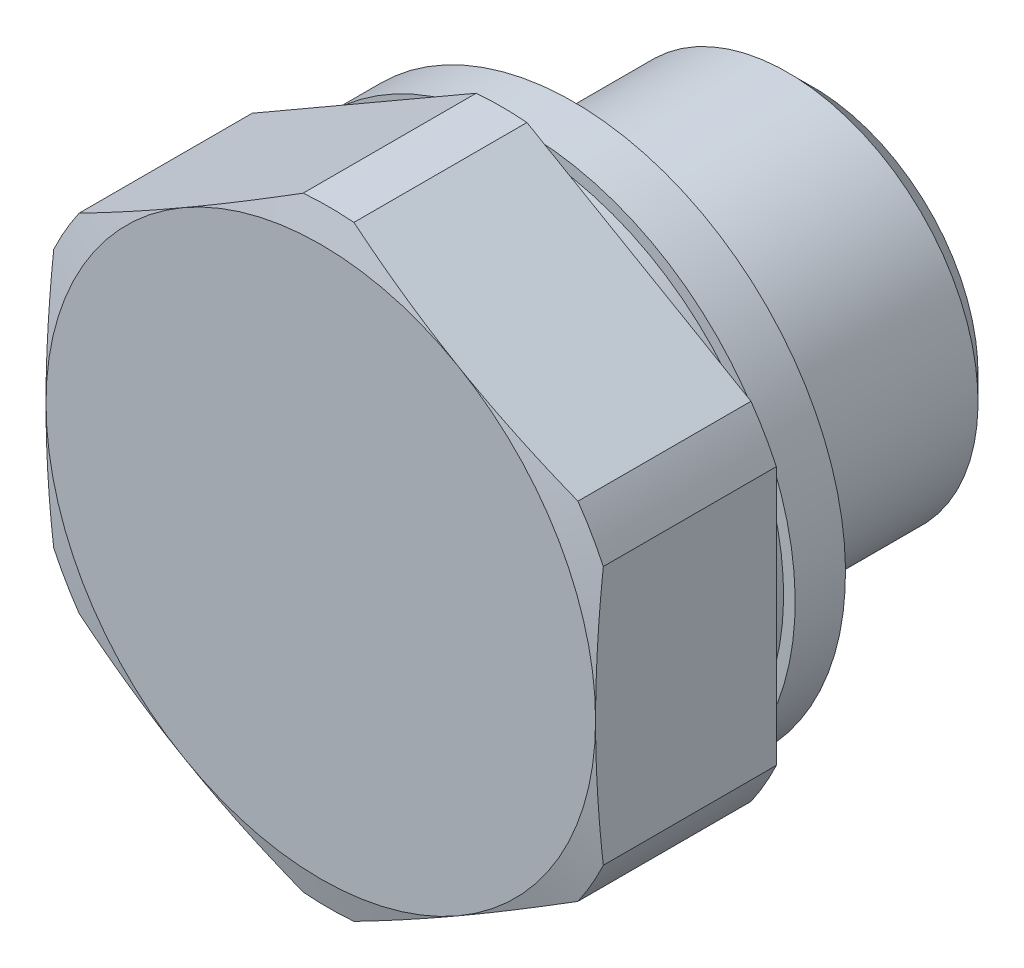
ISO-10303-21;
HEADER;
FILE_DESCRIPTION(('STEP AP214'),'2;1');
FILE_NAME('part.step','',(''),(''),'','','');
FILE_SCHEMA(('AUTOMOTIVE_DESIGN { 1 0 10303 214 1 1 1 1 }'));
ENDSEC;
DATA;
#1=APPLICATION_CONTEXT('core data for automotive mechanical design processes');
#2=APPLICATION_PROTOCOL_DEFINITION('international standard','automotive_design',2000,#1);
#3=PRODUCT_CONTEXT('',#1,'mechanical');
#4=PRODUCT('Part','Part','',(#3));
#5=PRODUCT_RELATED_PRODUCT_CATEGORY('part','',(#4));
#6=PRODUCT_DEFINITION_FORMATION('','',#4);
#7=PRODUCT_DEFINITION_CONTEXT('part definition',#1,'design');
#8=PRODUCT_DEFINITION('design','',#6,#7);
#9=PRODUCT_DEFINITION_SHAPE('','',#8);
#10=(LENGTH_UNIT() NAMED_UNIT(*) SI_UNIT(.MILLI.,.METRE.));
#11=(NAMED_UNIT(*) PLANE_ANGLE_UNIT() SI_UNIT($,.RADIAN.));
#12=(NAMED_UNIT(*) SI_UNIT($,.STERADIAN.) SOLID_ANGLE_UNIT());
#13=UNCERTAINTY_MEASURE_WITH_UNIT(LENGTH_MEASURE(1.E-05),#10,'distance_accuracy_value','');
#14=(GEOMETRIC_REPRESENTATION_CONTEXT(3) GLOBAL_UNCERTAINTY_ASSIGNED_CONTEXT((#13)) GLOBAL_UNIT_ASSIGNED_CONTEXT((#10,
#11,#12)) REPRESENTATION_CONTEXT('',''));
#15=CARTESIAN_POINT('',(0.,0.,0.));
#16=DIRECTION('',(0.,0.,1.));
#17=DIRECTION('',(1.,0.,0.));
#18=AXIS2_PLACEMENT_3D('',#15,#16,#17);
#19=CARTESIAN_POINT('',(0.,0.,-6.2999999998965));
#20=DIRECTION('',(0.,0.,-1.));
#21=DIRECTION('',(0.,1.,0.));
#22=AXIS2_PLACEMENT_3D('',#19,#20,#21);
#23=CONICAL_SURFACE('',#22,2.49999999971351,1.02974425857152);
#24=CARTESIAN_POINT('',(0.,-1.70530256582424E-10,-4.79784845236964));
#25=VERTEX_POINT('',#24);
#26=VERTEX_LOOP('',#25);
#27=FACE_BOUND('',#26,.T.);
#28=CARTESIAN_POINT('',(0.,0.,-6.3));
#29=DIRECTION('',(0.,0.,1.));
#30=DIRECTION('',(0.,-1.,0.));
#31=AXIS2_PLACEMENT_3D('',#28,#29,#30);
#32=CIRCLE('',#31,2.5);
#33=CARTESIAN_POINT('',(0.,-2.5,-6.3));
#34=VERTEX_POINT('',#33);
#35=EDGE_CURVE('E184',#34,#34,#32,.F.);
#36=ORIENTED_EDGE('',*,*,#35,.T.);
#37=EDGE_LOOP('',(#36));
#38=FACE_BOUND('',#37,.T.);
#39=ADVANCED_FACE('F14',(#27,#38),#23,.F.);
#40=CARTESIAN_POINT('',(0.,0.,-10.));
#41=DIRECTION('',(0.,0.,1.));
#42=DIRECTION('',(0.,-1.,0.));
#43=AXIS2_PLACEMENT_3D('',#40,#41,#42);
#44=CYLINDRICAL_SURFACE('',#43,2.5);
#45=CARTESIAN_POINT('',(0.,0.,-10.));
#46=DIRECTION('',(0.,0.,1.));
#47=DIRECTION('',(0.,-1.,0.));
#48=AXIS2_PLACEMENT_3D('',#45,#46,#47);
#49=CIRCLE('',#48,2.5);
#50=CARTESIAN_POINT('',(0.,-2.5,-10.));
#51=VERTEX_POINT('',#50);
#52=EDGE_CURVE('E17',#51,#51,#49,.F.);
#53=ORIENTED_EDGE('',*,*,#52,.T.);
#54=EDGE_LOOP('',(#53));
#55=FACE_BOUND('',#54,.T.);
#56=ORIENTED_EDGE('',*,*,#35,.F.);
#57=EDGE_LOOP('',(#56));
#58=FACE_BOUND('',#57,.T.);
#59=ADVANCED_FACE('F286',(#55,#58),#44,.F.);
#60=CARTESIAN_POINT('',(5.7225,0.,-10.));
#61=DIRECTION('',(0.,0.,1.));
#62=DIRECTION('',(0.,-1.,0.));
#63=AXIS2_PLACEMENT_3D('',#60,#61,#62);
#64=PLANE('',#63);
#65=CARTESIAN_POINT('',(0.,0.,-10.0000000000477));
#66=DIRECTION('',(0.,0.,1.));
#67=DIRECTION('',(0.,-1.,0.));
#68=AXIS2_PLACEMENT_3D('',#65,#66,#67);
#69=CIRCLE('',#68,5.72249999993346);
#70=CARTESIAN_POINT('',(0.,-5.72249999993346,-10.0000000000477));
#71=VERTEX_POINT('',#70);
#72=EDGE_CURVE('E181',#71,#71,#69,.T.);
#73=ORIENTED_EDGE('',*,*,#72,.F.);
#74=EDGE_LOOP('',(#73));
#75=FACE_BOUND('',#74,.T.);
#76=ORIENTED_EDGE('',*,*,#52,.F.);
#77=EDGE_LOOP('',(#76));
#78=FACE_BOUND('',#77,.T.);
#79=ADVANCED_FACE('F289',(#75,#78),#64,.F.);
#80=CARTESIAN_POINT('',(0.,0.,-9.14400000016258));
#81=DIRECTION('',(0.,0.,1.));
#82=DIRECTION('',(0.,-1.,0.));
#83=AXIS2_PLACEMENT_3D('',#80,#81,#82);
#84=CONICAL_SURFACE('',#83,6.57849999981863,0.785398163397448);
#85=CARTESIAN_POINT('',(0.,0.,-9.144));
#86=DIRECTION('',(0.,0.,1.));
#87=DIRECTION('',(0.,-1.,0.));
#88=AXIS2_PLACEMENT_3D('',#85,#86,#87);
#89=CIRCLE('',#88,6.5785);
#90=CARTESIAN_POINT('',(0.,-6.5785,-9.144));
#91=VERTEX_POINT('',#90);
#92=EDGE_CURVE('E176',#91,#91,#89,.T.);
#93=ORIENTED_EDGE('',*,*,#92,.F.);
#94=EDGE_LOOP('',(#93));
#95=FACE_BOUND('',#94,.T.);
#96=ORIENTED_EDGE('',*,*,#72,.T.);
#97=EDGE_LOOP('',(#96));
#98=FACE_BOUND('',#97,.T.);
#99=ADVANCED_FACE('F291',(#95,#98),#84,.T.);
#100=CARTESIAN_POINT('',(0.,0.,-10.));
#101=DIRECTION('',(0.,0.,1.));
#102=DIRECTION('',(0.,-1.,0.));
#103=AXIS2_PLACEMENT_3D('',#100,#101,#102);
#104=CYLINDRICAL_SURFACE('',#103,6.5785);
#105=CARTESIAN_POINT('',(0.,0.,-2.99421183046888));
#106=DIRECTION('',(0.,0.,-1.));
#107=DIRECTION('',(0.,1.,0.));
#108=AXIS2_PLACEMENT_3D('',#105,#106,#107);
#109=CIRCLE('',#108,6.57850000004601);
#110=CARTESIAN_POINT('',(0.,6.57850000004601,-2.99421183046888));
#111=VERTEX_POINT('',#110);
#112=EDGE_CURVE('E172',#111,#111,#109,.F.);
#113=ORIENTED_EDGE('',*,*,#112,.F.);
#114=EDGE_LOOP('',(#113));
#115=FACE_BOUND('',#114,.T.);
#116=ORIENTED_EDGE('',*,*,#92,.T.);
#117=EDGE_LOOP('',(#116));
#118=FACE_BOUND('',#117,.T.);
#119=ADVANCED_FACE('F299',(#115,#118),#104,.T.);
#120=CARTESIAN_POINT('',(0.,0.,-2.99421183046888));
#121=DIRECTION('',(0.,0.,-1.));
#122=DIRECTION('',(0.,1.,0.));
#123=AXIS2_PLACEMENT_3D('',#120,#121,#122);
#124=CONICAL_SURFACE('',#123,6.57850000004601,1.04719755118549);
#125=CARTESIAN_POINT('',(0.,0.,-2.49999999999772));
#126=DIRECTION('',(0.,0.,-1.));
#127=DIRECTION('',(0.,1.,0.));
#128=AXIS2_PLACEMENT_3D('',#125,#126,#127);
#129=CIRCLE('',#128,5.72249999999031);
#130=CARTESIAN_POINT('',(0.,5.72249999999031,-2.49999999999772));
#131=VERTEX_POINT('',#130);
#132=EDGE_CURVE('E175',#131,#131,#129,.T.);
#133=ORIENTED_EDGE('',*,*,#132,.T.);
#134=EDGE_LOOP('',(#133));
#135=FACE_BOUND('',#134,.T.);
#136=ORIENTED_EDGE('',*,*,#112,.T.);
#137=EDGE_LOOP('',(#136));
#138=FACE_BOUND('',#137,.T.);
#139=ADVANCED_FACE('F486',(#135,#138),#124,.T.);
#140=CARTESIAN_POINT('',(5.15,0.,-2.5));
#141=DIRECTION('',(0.,0.,-1.));
#142=DIRECTION('',(0.,1.,0.));
#143=AXIS2_PLACEMENT_3D('',#140,#141,#142);
#144=PLANE('',#143);
#145=CARTESIAN_POINT('',(0.,0.,-2.49999999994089));
#146=DIRECTION('',(0.,0.,1.));
#147=DIRECTION('',(0.,-1.,0.));
#148=AXIS2_PLACEMENT_3D('',#145,#146,#147);
#149=CIRCLE('',#148,5.15000000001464);
#150=CARTESIAN_POINT('',(0.,-5.15000000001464,-2.49999999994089));
#151=VERTEX_POINT('',#150);
#152=EDGE_CURVE('E276',#151,#151,#149,.T.);
#153=ORIENTED_EDGE('',*,*,#152,.F.);
#154=EDGE_LOOP('',(#153));
#155=FACE_BOUND('',#154,.T.);
#156=ORIENTED_EDGE('',*,*,#132,.F.);
#157=EDGE_LOOP('',(#156));
#158=FACE_BOUND('',#157,.T.);
#159=ADVANCED_FACE('F482',(#155,#158),#144,.F.);
#160=CARTESIAN_POINT('',(0.,0.,-1.70530256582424E-10));
#161=DIRECTION('',(0.,0.,1.));
#162=DIRECTION('',(0.,-1.,0.));
#163=AXIS2_PLACEMENT_3D('',#160,#161,#162);
#164=CONICAL_SURFACE('',#163,5.99999999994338,0.327738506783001);
#165=CARTESIAN_POINT('',(0.,0.,-5.6843418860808E-11));
#166=DIRECTION('',(0.,0.,1.));
#167=DIRECTION('',(0.,-1.,0.));
#168=AXIS2_PLACEMENT_3D('',#165,#166,#167);
#169=CIRCLE('',#168,5.99999999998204);
#170=CARTESIAN_POINT('',(0.,-5.99999999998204,-5.6843418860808E-11));
#171=VERTEX_POINT('',#170);
#172=EDGE_CURVE('E273',#171,#171,#169,.F.);
#173=ORIENTED_EDGE('',*,*,#172,.T.);
#174=EDGE_LOOP('',(#173));
#175=FACE_BOUND('',#174,.T.);
#176=ORIENTED_EDGE('',*,*,#152,.T.);
#177=EDGE_LOOP('',(#176));
#178=FACE_BOUND('',#177,.T.);
#179=ADVANCED_FACE('F478',(#175,#178),#164,.T.);
#180=CARTESIAN_POINT('',(9.,0.,0.));
#181=DIRECTION('',(0.,0.,1.));
#182=DIRECTION('',(0.,-1.,0.));
#183=AXIS2_PLACEMENT_3D('',#180,#181,#182);
#184=PLANE('',#183);
#185=CARTESIAN_POINT('',(0.,0.,0.));
#186=DIRECTION('',(0.,0.,1.));
#187=DIRECTION('',(0.,-1.,0.));
#188=AXIS2_PLACEMENT_3D('',#185,#186,#187);
#189=CIRCLE('',#188,6.5785);
#190=CARTESIAN_POINT('',(0.,-6.5785,0.));
#191=VERTEX_POINT('',#190);
#192=EDGE_CURVE('E270',#191,#191,#189,.F.);
#193=ORIENTED_EDGE('',*,*,#192,.T.);
#194=EDGE_LOOP('',(#193));
#195=FACE_BOUND('',#194,.T.);
#196=ORIENTED_EDGE('',*,*,#172,.F.);
#197=EDGE_LOOP('',(#196));
#198=FACE_BOUND('',#197,.T.);
#199=ADVANCED_FACE('F474',(#195,#198),#184,.F.);
#200=CARTESIAN_POINT('',(0.,0.,-1.74));
#201=DIRECTION('',(0.,0.,1.));
#202=DIRECTION('',(0.,-1.,0.));
#203=AXIS2_PLACEMENT_3D('',#200,#201,#202);
#204=CYLINDRICAL_SURFACE('',#203,6.5785);
#205=ORIENTED_EDGE('',*,*,#192,.F.);
#206=EDGE_LOOP('',(#205));
#207=FACE_BOUND('',#206,.T.);
#208=CARTESIAN_POINT('',(0.,0.,-1.74));
#209=DIRECTION('',(0.,0.,1.));
#210=DIRECTION('',(0.,-1.,0.));
#211=AXIS2_PLACEMENT_3D('',#208,#209,#210);
#212=CIRCLE('',#211,6.5785);
#213=CARTESIAN_POINT('',(0.,-6.5785,-1.74));
#214=VERTEX_POINT('',#213);
#215=EDGE_CURVE('E267',#214,#214,#212,.T.);
#216=ORIENTED_EDGE('',*,*,#215,.F.);
#217=EDGE_LOOP('',(#216));
#218=FACE_BOUND('',#217,.T.);
#219=ADVANCED_FACE('F470',(#207,#218),#204,.F.);
#220=CARTESIAN_POINT('',(6.5785,0.,-1.74));
#221=DIRECTION('',(0.,0.,-1.));
#222=DIRECTION('',(0.,1.,0.));
#223=AXIS2_PLACEMENT_3D('',#220,#221,#222);
#224=PLANE('',#223);
#225=ORIENTED_EDGE('',*,*,#215,.T.);
#226=EDGE_LOOP('',(#225));
#227=FACE_BOUND('',#226,.T.);
#228=CARTESIAN_POINT('',(0.,0.,-1.74));
#229=DIRECTION('',(0.,0.,1.));
#230=DIRECTION('',(0.,-1.,0.));
#231=AXIS2_PLACEMENT_3D('',#228,#229,#230);
#232=CIRCLE('',#231,9.4);
#233=CARTESIAN_POINT('',(0.,-9.4,-1.74));
#234=VERTEX_POINT('',#233);
#235=EDGE_CURVE('E264',#234,#234,#232,.T.);
#236=ORIENTED_EDGE('',*,*,#235,.F.);
#237=EDGE_LOOP('',(#236));
#238=FACE_BOUND('',#237,.T.);
#239=ADVANCED_FACE('F466',(#227,#238),#224,.T.);
#240=CARTESIAN_POINT('',(0.,0.,-1.74));
#241=DIRECTION('',(0.,0.,1.));
#242=DIRECTION('',(0.,-1.,0.));
#243=AXIS2_PLACEMENT_3D('',#240,#241,#242);
#244=CYLINDRICAL_SURFACE('',#243,9.4);
#245=ORIENTED_EDGE('',*,*,#235,.T.);
#246=EDGE_LOOP('',(#245));
#247=FACE_BOUND('',#246,.T.);
#248=CARTESIAN_POINT('',(0.,0.,0.));
#249=DIRECTION('',(0.,0.,1.));
#250=DIRECTION('',(0.,-1.,0.));
#251=AXIS2_PLACEMENT_3D('',#248,#249,#250);
#252=CIRCLE('',#251,9.4);
#253=CARTESIAN_POINT('',(0.,-9.4,0.));
#254=VERTEX_POINT('',#253);
#255=EDGE_CURVE('E261',#254,#254,#252,.T.);
#256=ORIENTED_EDGE('',*,*,#255,.F.);
#257=EDGE_LOOP('',(#256));
#258=FACE_BOUND('',#257,.T.);
#259=ADVANCED_FACE('F462',(#247,#258),#244,.T.);
#260=CARTESIAN_POINT('',(9.4,0.,0.));
#261=DIRECTION('',(0.,0.,1.));
#262=DIRECTION('',(0.,-1.,0.));
#263=AXIS2_PLACEMENT_3D('',#260,#261,#262);
#264=PLANE('',#263);
#265=ORIENTED_EDGE('',*,*,#255,.T.);
#266=EDGE_LOOP('',(#265));
#267=FACE_BOUND('',#266,.T.);
#268=CARTESIAN_POINT('',(0.,0.,0.));
#269=DIRECTION('',(0.,0.,1.));
#270=DIRECTION('',(0.,-1.,0.));
#271=AXIS2_PLACEMENT_3D('',#268,#269,#270);
#272=CIRCLE('',#271,9.);
#273=CARTESIAN_POINT('',(0.,-9.,0.));
#274=VERTEX_POINT('',#273);
#275=EDGE_CURVE('E258',#274,#274,#272,.T.);
#276=ORIENTED_EDGE('',*,*,#275,.F.);
#277=EDGE_LOOP('',(#276));
#278=FACE_BOUND('',#277,.T.);
#279=ADVANCED_FACE('F458',(#267,#278),#264,.T.);
#280=CARTESIAN_POINT('',(0.,0.,-10.));
#281=DIRECTION('',(0.,0.,1.));
#282=DIRECTION('',(0.,-1.,0.));
#283=AXIS2_PLACEMENT_3D('',#280,#281,#282);
#284=CYLINDRICAL_SURFACE('',#283,9.);
#285=CARTESIAN_POINT('',(0.,0.,0.75));
#286=DIRECTION('',(0.,0.,1.));
#287=DIRECTION('',(0.,-1.,0.));
#288=AXIS2_PLACEMENT_3D('',#285,#286,#287);
#289=CIRCLE('',#288,9.);
#290=CARTESIAN_POINT('',(0.,-9.,0.75));
#291=VERTEX_POINT('',#290);
#292=EDGE_CURVE('E141',#291,#291,#289,.F.);
#293=ORIENTED_EDGE('',*,*,#292,.T.);
#294=EDGE_LOOP('',(#293));
#295=FACE_BOUND('',#294,.T.);
#296=ORIENTED_EDGE('',*,*,#275,.T.);
#297=EDGE_LOOP('',(#296));
#298=FACE_BOUND('',#297,.T.);
#299=ADVANCED_FACE('F455',(#295,#298),#284,.T.);
#300=CARTESIAN_POINT('',(13.5,0.,0.75));
#301=DIRECTION('',(0.,0.,1.));
#302=DIRECTION('',(0.,-1.,0.));
#303=AXIS2_PLACEMENT_3D('',#300,#301,#302);
#304=PLANE('',#303);
#305=DIRECTION('',(0.866025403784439,0.5,0.));
#306=VECTOR('',#305,1.);
#307=CARTESIAN_POINT('',(0.,-10.9696551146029,0.75));
#308=LINE('',#307,#306);
#309=CARTESIAN_POINT('',(0.877016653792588,-10.463309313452,0.75));
#310=VERTEX_POINT('',#309);
#311=CARTESIAN_POINT('',(8.62298334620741,-5.99117335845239,0.75));
#312=VERTEX_POINT('',#311);
#313=EDGE_CURVE('E137',#310,#312,#308,.T.);
#314=ORIENTED_EDGE('',*,*,#313,.F.);
#315=CARTESIAN_POINT('',(0.,0.,0.75));
#316=DIRECTION('',(0.,0.,-1.));
#317=DIRECTION('',(0.,1.,0.));
#318=AXIS2_PLACEMENT_3D('',#315,#316,#317);
#319=CIRCLE('',#318,10.5);
#320=CARTESIAN_POINT('',(-0.877016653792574,-10.463309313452,0.75));
#321=VERTEX_POINT('',#320);
#322=EDGE_CURVE('E133',#321,#310,#319,.F.);
#323=ORIENTED_EDGE('',*,*,#322,.F.);
#324=DIRECTION('',(0.866025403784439,-0.5,0.));
#325=VECTOR('',#324,1.);
#326=CARTESIAN_POINT('',(-9.5,-5.48482755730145,0.75));
#327=LINE('',#326,#325);
#328=CARTESIAN_POINT('',(-8.62298334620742,-5.99117335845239,0.75));
#329=VERTEX_POINT('',#328);
#330=EDGE_CURVE('E117',#329,#321,#327,.T.);
#331=ORIENTED_EDGE('',*,*,#330,.F.);
#332=CARTESIAN_POINT('',(0.,0.,0.75));
#333=DIRECTION('',(0.,0.,-1.));
#334=DIRECTION('',(0.,1.,0.));
#335=AXIS2_PLACEMENT_3D('',#332,#333,#334);
#336=CIRCLE('',#335,10.5);
#337=CARTESIAN_POINT('',(-9.5,-4.47213595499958,0.75));
#338=VERTEX_POINT('',#337);
#339=EDGE_CURVE('E129',#338,#329,#336,.F.);
#340=ORIENTED_EDGE('',*,*,#339,.F.);
#341=DIRECTION('',(0.,-1.,0.));
#342=VECTOR('',#341,1.);
#343=CARTESIAN_POINT('',(-9.5,5.48482755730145,0.75));
#344=LINE('',#343,#342);
#345=CARTESIAN_POINT('',(-9.5,4.47213595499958,0.75));
#346=VERTEX_POINT('',#345);
#347=EDGE_CURVE('E169',#346,#338,#344,.T.);
#348=ORIENTED_EDGE('',*,*,#347,.F.);
#349=CARTESIAN_POINT('',(0.,0.,0.75));
#350=DIRECTION('',(0.,0.,-1.));
#351=DIRECTION('',(0.,1.,0.));
#352=AXIS2_PLACEMENT_3D('',#349,#350,#351);
#353=CIRCLE('',#352,10.5);
#354=CARTESIAN_POINT('',(-8.62298334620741,5.99117335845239,0.75));
#355=VERTEX_POINT('',#354);
#356=EDGE_CURVE('E147',#355,#346,#353,.F.);
#357=ORIENTED_EDGE('',*,*,#356,.F.);
#358=DIRECTION('',(-0.866025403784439,-0.5,0.));
#359=VECTOR('',#358,1.);
#360=CARTESIAN_POINT('',(0.,10.9696551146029,0.75));
#361=LINE('',#360,#359);
#362=CARTESIAN_POINT('',(-0.877016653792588,10.463309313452,0.75));
#363=VERTEX_POINT('',#362);
#364=EDGE_CURVE('E165',#363,#355,#361,.T.);
#365=ORIENTED_EDGE('',*,*,#364,.F.);
#366=CARTESIAN_POINT('',(0.,0.,0.75));
#367=DIRECTION('',(0.,0.,-1.));
#368=DIRECTION('',(0.,1.,0.));
#369=AXIS2_PLACEMENT_3D('',#366,#367,#368);
#370=CIRCLE('',#369,10.5);
#371=CARTESIAN_POINT('',(0.877016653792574,10.463309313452,0.75));
#372=VERTEX_POINT('',#371);
#373=EDGE_CURVE('E168',#372,#363,#370,.F.);
#374=ORIENTED_EDGE('',*,*,#373,.F.);
#375=DIRECTION('',(-0.866025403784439,0.5,0.));
#376=VECTOR('',#375,1.);
#377=CARTESIAN_POINT('',(9.5,5.48482755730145,0.75));
#378=LINE('',#377,#376);
#379=CARTESIAN_POINT('',(8.62298334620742,5.99117335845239,0.75));
#380=VERTEX_POINT('',#379);
#381=EDGE_CURVE('E161',#380,#372,#378,.T.);
#382=ORIENTED_EDGE('',*,*,#381,.F.);
#383=CARTESIAN_POINT('',(0.,0.,0.75));
#384=DIRECTION('',(0.,0.,-1.));
#385=DIRECTION('',(0.,1.,0.));
#386=AXIS2_PLACEMENT_3D('',#383,#384,#385);
#387=CIRCLE('',#386,10.5);
#388=CARTESIAN_POINT('',(9.5,4.47213595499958,0.75));
#389=VERTEX_POINT('',#388);
#390=EDGE_CURVE('E164',#389,#380,#387,.F.);
#391=ORIENTED_EDGE('',*,*,#390,.F.);
#392=DIRECTION('',(0.,1.,0.));
#393=VECTOR('',#392,1.);
#394=CARTESIAN_POINT('',(9.5,-5.48482755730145,0.75));
#395=LINE('',#394,#393);
#396=CARTESIAN_POINT('',(9.5,-4.47213595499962,0.75));
#397=VERTEX_POINT('',#396);
#398=EDGE_CURVE('E157',#397,#389,#395,.T.);
#399=ORIENTED_EDGE('',*,*,#398,.F.);
#400=CARTESIAN_POINT('',(0.,0.,0.75));
#401=DIRECTION('',(0.,0.,-1.));
#402=DIRECTION('',(0.,1.,0.));
#403=AXIS2_PLACEMENT_3D('',#400,#401,#402);
#404=CIRCLE('',#403,10.5);
#405=EDGE_CURVE('E160',#312,#397,#404,.F.);
#406=ORIENTED_EDGE('',*,*,#405,.F.);
#407=EDGE_LOOP('',(#314,#323,#331,#340,#348,#357,#365,#374,#382,#391,#399,#406));
#408=FACE_BOUND('',#407,.T.);
#409=ORIENTED_EDGE('',*,*,#292,.F.);
#410=EDGE_LOOP('',(#409));
#411=FACE_BOUND('',#410,.T.);
#412=ADVANCED_FACE('F134',(#408,#411),#304,.F.);
#413=CARTESIAN_POINT('',(0.,0.,0.));
#414=DIRECTION('',(0.,0.,-1.));
#415=DIRECTION('',(0.,1.,0.));
#416=AXIS2_PLACEMENT_3D('',#413,#414,#415);
#417=CYLINDRICAL_SURFACE('',#416,10.5);
#418=CARTESIAN_POINT('',(0.,0.,6.73205080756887));
#419=DIRECTION('',(0.,0.,-1.));
#420=DIRECTION('',(0.,1.,0.));
#421=AXIS2_PLACEMENT_3D('',#418,#419,#420);
#422=CIRCLE('',#421,10.5);
#423=CARTESIAN_POINT('',(-0.877016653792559,-10.463309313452,6.73205080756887));
#424=VERTEX_POINT('',#423);
#425=CARTESIAN_POINT('',(0.877016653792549,-10.463309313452,6.73205080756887));
#426=VERTEX_POINT('',#425);
#427=EDGE_CURVE('E145',#424,#426,#422,.F.);
#428=ORIENTED_EDGE('',*,*,#427,.F.);
#429=DIRECTION('',(0.,0.,1.));
#430=VECTOR('',#429,1.);
#431=CARTESIAN_POINT('',(-0.877016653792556,-10.463309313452,0.));
#432=LINE('',#431,#430);
#433=EDGE_CURVE('E123',#321,#424,#432,.T.);
#434=ORIENTED_EDGE('',*,*,#433,.F.);
#435=ORIENTED_EDGE('',*,*,#322,.T.);
#436=DIRECTION('',(0.,0.,1.));
#437=VECTOR('',#436,1.);
#438=CARTESIAN_POINT('',(0.877016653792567,-10.463309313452,0.));
#439=LINE('',#438,#437);
#440=EDGE_CURVE('E153',#426,#310,#439,.F.);
#441=ORIENTED_EDGE('',*,*,#440,.F.);
#442=EDGE_LOOP('',(#428,#434,#435,#441));
#443=FACE_BOUND('',#442,.T.);
#444=ADVANCED_FACE('F144',(#443),#417,.T.);
#445=CARTESIAN_POINT('',(0.,0.,0.));
#446=DIRECTION('',(0.,0.,-1.));
#447=DIRECTION('',(0.,1.,0.));
#448=AXIS2_PLACEMENT_3D('',#445,#446,#447);
#449=CYLINDRICAL_SURFACE('',#448,10.5);
#450=CARTESIAN_POINT('',(0.,0.,6.73205080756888));
#451=DIRECTION('',(0.,0.,-1.));
#452=DIRECTION('',(0.,1.,0.));
#453=AXIS2_PLACEMENT_3D('',#450,#451,#452);
#454=CIRCLE('',#453,10.5);
#455=CARTESIAN_POINT('',(-9.5,-4.47213595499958,6.73205080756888));
#456=VERTEX_POINT('',#455);
#457=CARTESIAN_POINT('',(-8.62298334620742,-5.99117335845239,6.73205080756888));
#458=VERTEX_POINT('',#457);
#459=EDGE_CURVE('E430',#456,#458,#454,.F.);
#460=ORIENTED_EDGE('',*,*,#459,.F.);
#461=DIRECTION('',(0.,0.,1.));
#462=VECTOR('',#461,1.);
#463=CARTESIAN_POINT('',(-9.5,-4.47213595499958,0.));
#464=LINE('',#463,#462);
#465=EDGE_CURVE('E170',#338,#456,#464,.T.);
#466=ORIENTED_EDGE('',*,*,#465,.F.);
#467=ORIENTED_EDGE('',*,*,#339,.T.);
#468=DIRECTION('',(0.,0.,1.));
#469=VECTOR('',#468,1.);
#470=CARTESIAN_POINT('',(-8.62298334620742,-5.99117335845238,0.));
#471=LINE('',#470,#469);
#472=EDGE_CURVE('E126',#458,#329,#471,.F.);
#473=ORIENTED_EDGE('',*,*,#472,.F.);
#474=EDGE_LOOP('',(#460,#466,#467,#473));
#475=FACE_BOUND('',#474,.T.);
#476=ADVANCED_FACE('F433',(#475),#449,.T.);
#477=CARTESIAN_POINT('',(-9.5,-5.48482755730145,0.));
#478=DIRECTION('',(-0.5,-0.866025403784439,0.));
#479=DIRECTION('',(0.866025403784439,-0.5,0.));
#480=AXIS2_PLACEMENT_3D('',#477,#478,#479);
#481=PLANE('',#480);
#482=CARTESIAN_POINT('',(-8.62298334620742,-5.99117335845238,6.73205080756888));
#483=CARTESIAN_POINT('',(-8.30146981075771,-6.17679928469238,6.77444751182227));
#484=CARTESIAN_POINT('',(-7.9795052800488,-6.36268559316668,6.81253431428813));
#485=CARTESIAN_POINT('',(-7.33509348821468,-6.73473691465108,6.87894573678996));
#486=CARTESIAN_POINT('',(-7.01264684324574,-6.92090157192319,6.90727837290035));
#487=CARTESIAN_POINT('',(-6.3671217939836,-7.29359563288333,6.95311530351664));
#488=CARTESIAN_POINT('',(-6.04404331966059,-7.4801250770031,6.97061832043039));
#489=CARTESIAN_POINT('',(-5.55906653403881,-7.76012655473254,6.98820474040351));
#490=CARTESIAN_POINT('',(-5.39727920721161,-7.8535345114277,6.9926222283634));
#491=CARTESIAN_POINT('',(-5.07366224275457,-8.0403748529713,6.99852220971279));
#492=CARTESIAN_POINT('',(-4.91183260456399,-8.13380723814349,7.00000466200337));
#493=CARTESIAN_POINT('',(-4.75,-8.22724133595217,7.));
#494=B_SPLINE_CURVE_WITH_KNOTS('',3,(#482,#483,#484,#485,#486,#487,#488,#489,#490,#491,#492,
#493),.UNSPECIFIED.,.F.,.F.,(4,2,2,2,2,4),(0.,1.12101038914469,2.24109730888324,
3.36131634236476,3.92190059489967,4.48249269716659),.UNSPECIFIED.);
#495=CARTESIAN_POINT('',(-4.75,-8.22724133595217,7.));
#496=VERTEX_POINT('',#495);
#497=EDGE_CURVE('E384',#458,#496,#494,.T.);
#498=ORIENTED_EDGE('',*,*,#497,.F.);
#499=ORIENTED_EDGE('',*,*,#472,.T.);
#500=ORIENTED_EDGE('',*,*,#330,.T.);
#501=ORIENTED_EDGE('',*,*,#433,.T.);
#502=CARTESIAN_POINT('',(-4.75,-8.22724133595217,7.));
#503=CARTESIAN_POINT('',(-4.58816739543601,-8.32067543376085,7.00000466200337));
#504=CARTESIAN_POINT('',(-4.42633775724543,-8.41410781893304,6.99852220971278));
#505=CARTESIAN_POINT('',(-4.10272079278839,-8.60094816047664,6.99262222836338));
#506=CARTESIAN_POINT('',(-3.94093346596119,-8.6943561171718,6.9882047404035));
#507=CARTESIAN_POINT('',(-3.45595668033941,-8.97435759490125,6.97061832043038));
#508=CARTESIAN_POINT('',(-3.1328782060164,-9.16088703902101,6.95311530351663));
#509=CARTESIAN_POINT('',(-2.48735315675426,-9.53358109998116,6.90727837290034));
#510=CARTESIAN_POINT('',(-2.16490651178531,-9.71974575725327,6.87894573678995));
#511=CARTESIAN_POINT('',(-1.52049471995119,-10.0917970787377,6.81253431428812));
#512=CARTESIAN_POINT('',(-1.19853018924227,-10.277683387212,6.77444751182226));
#513=CARTESIAN_POINT('',(-0.877016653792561,-10.463309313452,6.73205080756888));
#514=B_SPLINE_CURVE_WITH_KNOTS('',3,(#502,#503,#504,#505,#506,#507,#508,#509,#510,#511,#512,
#513),.UNSPECIFIED.,.F.,.F.,(4,2,2,2,2,4),(0.,0.560592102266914,1.12117635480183,
2.24139538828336,3.36148230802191,4.48249269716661),.UNSPECIFIED.);
#515=EDGE_CURVE('E241',#496,#424,#514,.T.);
#516=ORIENTED_EDGE('',*,*,#515,.F.);
#517=EDGE_LOOP('',(#498,#499,#500,#501,#516));
#518=FACE_BOUND('',#517,.T.);
#519=ADVANCED_FACE('F120',(#518),#481,.T.);
#520=CARTESIAN_POINT('',(0.,0.,0.));
#521=DIRECTION('',(0.,0.,-1.));
#522=DIRECTION('',(0.,1.,0.));
#523=AXIS2_PLACEMENT_3D('',#520,#521,#522);
#524=CYLINDRICAL_SURFACE('',#523,10.5);
#525=CARTESIAN_POINT('',(0.,0.,6.73205080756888));
#526=DIRECTION('',(0.,0.,-1.));
#527=DIRECTION('',(0.,1.,0.));
#528=AXIS2_PLACEMENT_3D('',#525,#526,#527);
#529=CIRCLE('',#528,10.5);
#530=CARTESIAN_POINT('',(-8.62298334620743,5.99117335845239,6.73205080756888));
#531=VERTEX_POINT('',#530);
#532=CARTESIAN_POINT('',(-9.5,4.47213595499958,6.73205080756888));
#533=VERTEX_POINT('',#532);
#534=EDGE_CURVE('E339',#531,#533,#529,.F.);
#535=ORIENTED_EDGE('',*,*,#534,.F.);
#536=DIRECTION('',(0.,0.,1.));
#537=VECTOR('',#536,1.);
#538=CARTESIAN_POINT('',(-8.62298334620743,5.99117335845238,0.));
#539=LINE('',#538,#537);
#540=EDGE_CURVE('E167',#355,#531,#539,.T.);
#541=ORIENTED_EDGE('',*,*,#540,.F.);
#542=ORIENTED_EDGE('',*,*,#356,.T.);
#543=DIRECTION('',(0.,0.,1.));
#544=VECTOR('',#543,1.);
#545=CARTESIAN_POINT('',(-9.5,4.47213595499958,0.));
#546=LINE('',#545,#544);
#547=EDGE_CURVE('E253',#533,#346,#546,.F.);
#548=ORIENTED_EDGE('',*,*,#547,.F.);
#549=EDGE_LOOP('',(#535,#541,#542,#548));
#550=FACE_BOUND('',#549,.T.);
#551=ADVANCED_FACE('F375',(#550),#524,.T.);
#552=CARTESIAN_POINT('',(-9.5,5.48482755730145,0.));
#553=DIRECTION('',(-1.,0.,0.));
#554=DIRECTION('',(0.,-1.,0.));
#555=AXIS2_PLACEMENT_3D('',#552,#553,#554);
#556=PLANE('',#555);
#557=CARTESIAN_POINT('',(-9.5,4.47213595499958,6.73205080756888));
#558=CARTESIAN_POINT('',(-9.5,4.10088410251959,6.77444751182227));
#559=CARTESIAN_POINT('',(-9.5,3.72911148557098,6.81253431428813));
#560=CARTESIAN_POINT('',(-9.5,2.98500884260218,6.87894573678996));
#561=CARTESIAN_POINT('',(-9.5,2.61267952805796,6.90727837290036));
#562=CARTESIAN_POINT('',(-9.5,1.86729140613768,6.95311530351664));
#563=CARTESIAN_POINT('',(-9.5,1.49423251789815,6.97061832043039));
#564=CARTESIAN_POINT('',(-9.5,0.934229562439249,6.98820474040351));
#565=CARTESIAN_POINT('',(-9.5,0.747413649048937,6.9926222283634));
#566=CARTESIAN_POINT('',(-9.5,0.373732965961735,6.99852220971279));
#567=CARTESIAN_POINT('',(-9.5,0.186868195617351,7.00000466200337));
#568=CARTESIAN_POINT('',(-9.5,0.,7.));
#569=B_SPLINE_CURVE_WITH_KNOTS('',3,(#557,#558,#559,#560,#561,#562,#563,#564,#565,#566,#567,
#568),.UNSPECIFIED.,.F.,.F.,(4,2,2,2,2,4),(0.,1.12101038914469,2.24109730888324,
3.36131634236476,3.92190059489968,4.48249269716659),.UNSPECIFIED.);
#570=CARTESIAN_POINT('',(-9.5,0.,7.));
#571=VERTEX_POINT('',#570);
#572=EDGE_CURVE('E336',#533,#571,#569,.T.);
#573=ORIENTED_EDGE('',*,*,#572,.F.);
#574=ORIENTED_EDGE('',*,*,#547,.T.);
#575=ORIENTED_EDGE('',*,*,#347,.T.);
#576=ORIENTED_EDGE('',*,*,#465,.T.);
#577=CARTESIAN_POINT('',(-9.5,0.,7.));
#578=CARTESIAN_POINT('',(-9.5,-0.186868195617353,7.00000466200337));
#579=CARTESIAN_POINT('',(-9.5,-0.373732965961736,6.99852220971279));
#580=CARTESIAN_POINT('',(-9.5,-0.747413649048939,6.9926222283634));
#581=CARTESIAN_POINT('',(-9.5,-0.934229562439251,6.98820474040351));
#582=CARTESIAN_POINT('',(-9.5,-1.49423251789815,6.97061832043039));
#583=CARTESIAN_POINT('',(-9.5,-1.86729140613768,6.95311530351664));
#584=CARTESIAN_POINT('',(-9.5,-2.61267952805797,6.90727837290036));
#585=CARTESIAN_POINT('',(-9.5,-2.98500884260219,6.87894573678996));
#586=CARTESIAN_POINT('',(-9.5,-3.72911148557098,6.81253431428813));
#587=CARTESIAN_POINT('',(-9.5,-4.10088410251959,6.77444751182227));
#588=CARTESIAN_POINT('',(-9.5,-4.47213595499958,6.73205080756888));
#589=B_SPLINE_CURVE_WITH_KNOTS('',3,(#577,#578,#579,#580,#581,#582,#583,#584,#585,#586,#587,
#588),.UNSPECIFIED.,.F.,.F.,(4,2,2,2,2,4),(0.,0.560592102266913,1.12117635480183,
2.24139538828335,3.3614823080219,4.48249269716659),.UNSPECIFIED.);
#590=EDGE_CURVE('E378',#571,#456,#589,.T.);
#591=ORIENTED_EDGE('',*,*,#590,.F.);
#592=EDGE_LOOP('',(#573,#574,#575,#576,#591));
#593=FACE_BOUND('',#592,.T.);
#594=ADVANCED_FACE('F370',(#593),#556,.T.);
#595=CARTESIAN_POINT('',(0.,0.,0.));
#596=DIRECTION('',(0.,0.,-1.));
#597=DIRECTION('',(0.,1.,0.));
#598=AXIS2_PLACEMENT_3D('',#595,#596,#597);
#599=CYLINDRICAL_SURFACE('',#598,10.5);
#600=CARTESIAN_POINT('',(0.,0.,6.73205080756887));
#601=DIRECTION('',(0.,0.,-1.));
#602=DIRECTION('',(0.,1.,0.));
#603=AXIS2_PLACEMENT_3D('',#600,#601,#602);
#604=CIRCLE('',#603,10.5);
#605=CARTESIAN_POINT('',(0.87701665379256,10.463309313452,6.73205080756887));
#606=VERTEX_POINT('',#605);
#607=CARTESIAN_POINT('',(-0.877016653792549,10.463309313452,6.73205080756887));
#608=VERTEX_POINT('',#607);
#609=EDGE_CURVE('E325',#606,#608,#604,.F.);
#610=ORIENTED_EDGE('',*,*,#609,.F.);
#611=DIRECTION('',(0.,0.,1.));
#612=VECTOR('',#611,1.);
#613=CARTESIAN_POINT('',(0.877016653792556,10.463309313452,0.));
#614=LINE('',#613,#612);
#615=EDGE_CURVE('E163',#372,#606,#614,.T.);
#616=ORIENTED_EDGE('',*,*,#615,.F.);
#617=ORIENTED_EDGE('',*,*,#373,.T.);
#618=DIRECTION('',(0.,0.,1.));
#619=VECTOR('',#618,1.);
#620=CARTESIAN_POINT('',(-0.877016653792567,10.463309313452,0.));
#621=LINE('',#620,#619);
#622=EDGE_CURVE('E251',#608,#363,#621,.F.);
#623=ORIENTED_EDGE('',*,*,#622,.F.);
#624=EDGE_LOOP('',(#610,#616,#617,#623));
#625=FACE_BOUND('',#624,.T.);
#626=ADVANCED_FACE('F366',(#625),#599,.T.);
#627=CARTESIAN_POINT('',(0.,10.9696551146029,0.));
#628=DIRECTION('',(-0.5,0.866025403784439,0.));
#629=DIRECTION('',(-0.866025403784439,-0.5,0.));
#630=AXIS2_PLACEMENT_3D('',#627,#628,#629);
#631=PLANE('',#630);
#632=CARTESIAN_POINT('',(-0.87701665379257,10.463309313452,6.73205080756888));
#633=CARTESIAN_POINT('',(-1.19853018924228,10.277683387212,6.77444751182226));
#634=CARTESIAN_POINT('',(-1.52049471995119,10.0917970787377,6.81253431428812));
#635=CARTESIAN_POINT('',(-2.16490651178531,9.71974575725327,6.87894573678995));
#636=CARTESIAN_POINT('',(-2.48735315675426,9.53358109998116,6.90727837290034));
#637=CARTESIAN_POINT('',(-3.1328782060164,9.16088703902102,6.95311530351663));
#638=CARTESIAN_POINT('',(-3.45595668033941,8.97435759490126,6.97061832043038));
#639=CARTESIAN_POINT('',(-3.94093346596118,8.69435611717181,6.9882047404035));
#640=CARTESIAN_POINT('',(-4.10272079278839,8.60094816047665,6.99262222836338));
#641=CARTESIAN_POINT('',(-4.42633775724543,8.41410781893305,6.99852220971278));
#642=CARTESIAN_POINT('',(-4.58816739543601,8.32067543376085,7.00000466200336));
#643=CARTESIAN_POINT('',(-4.75,8.22724133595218,7.));
#644=B_SPLINE_CURVE_WITH_KNOTS('',3,(#632,#633,#634,#635,#636,#637,#638,#639,#640,#641,#642,
#643),.UNSPECIFIED.,.F.,.F.,(4,2,2,2,2,4),(0.,1.12101038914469,2.24109730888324,
3.36131634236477,3.92190059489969,4.4824926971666),.UNSPECIFIED.);
#645=CARTESIAN_POINT('',(-4.75,8.22724133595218,7.));
#646=VERTEX_POINT('',#645);
#647=EDGE_CURVE('E323',#608,#646,#644,.T.);
#648=ORIENTED_EDGE('',*,*,#647,.F.);
#649=ORIENTED_EDGE('',*,*,#622,.T.);
#650=ORIENTED_EDGE('',*,*,#364,.T.);
#651=ORIENTED_EDGE('',*,*,#540,.T.);
#652=CARTESIAN_POINT('',(-4.75,8.22724133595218,7.));
#653=CARTESIAN_POINT('',(-4.91183260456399,8.1338072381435,7.00000466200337));
#654=CARTESIAN_POINT('',(-5.07366224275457,8.04037485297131,6.99852220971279));
#655=CARTESIAN_POINT('',(-5.39727920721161,7.85353451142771,6.99262222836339));
#656=CARTESIAN_POINT('',(-5.55906653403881,7.76012655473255,6.98820474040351));
#657=CARTESIAN_POINT('',(-6.04404331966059,7.4801250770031,6.97061832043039));
#658=CARTESIAN_POINT('',(-6.3671217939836,7.29359563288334,6.95311530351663));
#659=CARTESIAN_POINT('',(-7.01264684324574,6.92090157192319,6.90727837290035));
#660=CARTESIAN_POINT('',(-7.33509348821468,6.73473691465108,6.87894573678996));
#661=CARTESIAN_POINT('',(-7.97950528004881,6.36268559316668,6.81253431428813));
#662=CARTESIAN_POINT('',(-8.30146981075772,6.17679928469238,6.77444751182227));
#663=CARTESIAN_POINT('',(-8.62298334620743,5.99117335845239,6.73205080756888));
#664=B_SPLINE_CURVE_WITH_KNOTS('',3,(#652,#653,#654,#655,#656,#657,#658,#659,#660,#661,#662,
#663),.UNSPECIFIED.,.F.,.F.,(4,2,2,2,2,4),(0.,0.560592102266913,1.12117635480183,
2.24139538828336,3.3614823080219,4.4824926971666),.UNSPECIFIED.);
#665=EDGE_CURVE('E331',#646,#531,#664,.T.);
#666=ORIENTED_EDGE('',*,*,#665,.F.);
#667=EDGE_LOOP('',(#648,#649,#650,#651,#666));
#668=FACE_BOUND('',#667,.T.);
#669=ADVANCED_FACE('F332',(#668),#631,.T.);
#670=CARTESIAN_POINT('',(0.,0.,0.));
#671=DIRECTION('',(0.,0.,-1.));
#672=DIRECTION('',(0.,1.,0.));
#673=AXIS2_PLACEMENT_3D('',#670,#671,#672);
#674=CYLINDRICAL_SURFACE('',#673,10.5);
#675=CARTESIAN_POINT('',(0.,0.,6.73205080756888));
#676=DIRECTION('',(0.,0.,-1.));
#677=DIRECTION('',(0.,1.,0.));
#678=AXIS2_PLACEMENT_3D('',#675,#676,#677);
#679=CIRCLE('',#678,10.5);
#680=CARTESIAN_POINT('',(9.5,4.47213595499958,6.73205080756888));
#681=VERTEX_POINT('',#680);
#682=CARTESIAN_POINT('',(8.62298334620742,5.99117335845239,6.73205080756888));
#683=VERTEX_POINT('',#682);
#684=EDGE_CURVE('E420',#681,#683,#679,.F.);
#685=ORIENTED_EDGE('',*,*,#684,.F.);
#686=DIRECTION('',(0.,0.,1.));
#687=VECTOR('',#686,1.);
#688=CARTESIAN_POINT('',(9.5,4.47213595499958,0.));
#689=LINE('',#688,#687);
#690=EDGE_CURVE('E159',#389,#681,#689,.T.);
#691=ORIENTED_EDGE('',*,*,#690,.F.);
#692=ORIENTED_EDGE('',*,*,#390,.T.);
#693=DIRECTION('',(0.,0.,1.));
#694=VECTOR('',#693,1.);
#695=CARTESIAN_POINT('',(8.62298334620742,5.99117335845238,0.));
#696=LINE('',#695,#694);
#697=EDGE_CURVE('E249',#683,#380,#696,.F.);
#698=ORIENTED_EDGE('',*,*,#697,.F.);
#699=EDGE_LOOP('',(#685,#691,#692,#698));
#700=FACE_BOUND('',#699,.T.);
#701=ADVANCED_FACE('F365',(#700),#674,.T.);
#702=CARTESIAN_POINT('',(9.5,5.48482755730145,0.));
#703=DIRECTION('',(0.5,0.866025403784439,0.));
#704=DIRECTION('',(-0.866025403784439,0.5,0.));
#705=AXIS2_PLACEMENT_3D('',#702,#703,#704);
#706=PLANE('',#705);
#707=CARTESIAN_POINT('',(8.62298334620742,5.99117335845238,6.73205080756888));
#708=CARTESIAN_POINT('',(8.30146981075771,6.17679928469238,6.77444751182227));
#709=CARTESIAN_POINT('',(7.9795052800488,6.36268559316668,6.81253431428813));
#710=CARTESIAN_POINT('',(7.33509348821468,6.73473691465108,6.87894573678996));
#711=CARTESIAN_POINT('',(7.01264684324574,6.92090157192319,6.90727837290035));
#712=CARTESIAN_POINT('',(6.3671217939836,7.29359563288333,6.95311530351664));
#713=CARTESIAN_POINT('',(6.04404331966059,7.4801250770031,6.97061832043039));
#714=CARTESIAN_POINT('',(5.55906653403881,7.76012655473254,6.98820474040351));
#715=CARTESIAN_POINT('',(5.39727920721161,7.8535345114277,6.9926222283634));
#716=CARTESIAN_POINT('',(5.07366224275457,8.0403748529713,6.99852220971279));
#717=CARTESIAN_POINT('',(4.91183260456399,8.13380723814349,7.00000466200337));
#718=CARTESIAN_POINT('',(4.75,8.22724133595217,7.));
#719=B_SPLINE_CURVE_WITH_KNOTS('',3,(#707,#708,#709,#710,#711,#712,#713,#714,#715,#716,#717,
#718),.UNSPECIFIED.,.F.,.F.,(4,2,2,2,2,4),(0.,1.12101038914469,2.24109730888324,
3.36131634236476,3.92190059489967,4.48249269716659),.UNSPECIFIED.);
#720=CARTESIAN_POINT('',(4.75,8.22724133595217,7.));
#721=VERTEX_POINT('',#720);
#722=EDGE_CURVE('E414',#683,#721,#719,.T.);
#723=ORIENTED_EDGE('',*,*,#722,.F.);
#724=ORIENTED_EDGE('',*,*,#697,.T.);
#725=ORIENTED_EDGE('',*,*,#381,.T.);
#726=ORIENTED_EDGE('',*,*,#615,.T.);
#727=CARTESIAN_POINT('',(4.75,8.22724133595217,7.));
#728=CARTESIAN_POINT('',(4.58816739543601,8.32067543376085,7.00000466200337));
#729=CARTESIAN_POINT('',(4.42633775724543,8.41410781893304,6.99852220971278));
#730=CARTESIAN_POINT('',(4.10272079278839,8.60094816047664,6.99262222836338));
#731=CARTESIAN_POINT('',(3.94093346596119,8.6943561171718,6.9882047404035));
#732=CARTESIAN_POINT('',(3.45595668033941,8.97435759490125,6.97061832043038));
#733=CARTESIAN_POINT('',(3.1328782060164,9.16088703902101,6.95311530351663));
#734=CARTESIAN_POINT('',(2.48735315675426,9.53358109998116,6.90727837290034));
#735=CARTESIAN_POINT('',(2.16490651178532,9.71974575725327,6.87894573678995));
#736=CARTESIAN_POINT('',(1.52049471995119,10.0917970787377,6.81253431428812));
#737=CARTESIAN_POINT('',(1.19853018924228,10.277683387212,6.77444751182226));
#738=CARTESIAN_POINT('',(0.877016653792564,10.463309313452,6.73205080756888));
#739=B_SPLINE_CURVE_WITH_KNOTS('',3,(#727,#728,#729,#730,#731,#732,#733,#734,#735,#736,#737,
#738),.UNSPECIFIED.,.F.,.F.,(4,2,2,2,2,4),(0.,0.560592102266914,1.12117635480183,
2.24139538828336,3.36148230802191,4.4824926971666),.UNSPECIFIED.);
#740=EDGE_CURVE('E320',#721,#606,#739,.T.);
#741=ORIENTED_EDGE('',*,*,#740,.F.);
#742=EDGE_LOOP('',(#723,#724,#725,#726,#741));
#743=FACE_BOUND('',#742,.T.);
#744=ADVANCED_FACE('F589',(#743),#706,.T.);
#745=CARTESIAN_POINT('',(0.,0.,0.));
#746=DIRECTION('',(0.,0.,-1.));
#747=DIRECTION('',(0.,1.,0.));
#748=AXIS2_PLACEMENT_3D('',#745,#746,#747);
#749=CYLINDRICAL_SURFACE('',#748,10.5);
#750=CARTESIAN_POINT('',(0.,0.,6.73205080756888));
#751=DIRECTION('',(0.,0.,-1.));
#752=DIRECTION('',(0.,1.,0.));
#753=AXIS2_PLACEMENT_3D('',#750,#751,#752);
#754=CIRCLE('',#753,10.5);
#755=CARTESIAN_POINT('',(8.62298334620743,-5.99117335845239,6.73205080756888));
#756=VERTEX_POINT('',#755);
#757=CARTESIAN_POINT('',(9.5,-4.47213595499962,6.73205080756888));
#758=VERTEX_POINT('',#757);
#759=EDGE_CURVE('E407',#756,#758,#754,.F.);
#760=ORIENTED_EDGE('',*,*,#759,.F.);
#761=DIRECTION('',(0.,0.,1.));
#762=VECTOR('',#761,1.);
#763=CARTESIAN_POINT('',(8.62298334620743,-5.99117335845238,0.));
#764=LINE('',#763,#762);
#765=EDGE_CURVE('E155',#312,#756,#764,.T.);
#766=ORIENTED_EDGE('',*,*,#765,.F.);
#767=ORIENTED_EDGE('',*,*,#405,.T.);
#768=DIRECTION('',(0.,0.,1.));
#769=VECTOR('',#768,1.);
#770=CARTESIAN_POINT('',(9.5,-4.47213595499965,0.));
#771=LINE('',#770,#769);
#772=EDGE_CURVE('E156',#758,#397,#771,.F.);
#773=ORIENTED_EDGE('',*,*,#772,.F.);
#774=EDGE_LOOP('',(#760,#766,#767,#773));
#775=FACE_BOUND('',#774,.T.);
#776=ADVANCED_FACE('F410',(#775),#749,.T.);
#777=CARTESIAN_POINT('',(9.5,-5.48482755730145,0.));
#778=DIRECTION('',(1.,0.,0.));
#779=DIRECTION('',(0.,1.,0.));
#780=AXIS2_PLACEMENT_3D('',#777,#778,#779);
#781=PLANE('',#780);
#782=CARTESIAN_POINT('',(9.5,-4.47213595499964,6.73205080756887));
#783=CARTESIAN_POINT('',(9.5,-4.10088410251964,6.77444751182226));
#784=CARTESIAN_POINT('',(9.5,-3.72911148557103,6.81253431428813));
#785=CARTESIAN_POINT('',(9.5,-2.98500884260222,6.87894573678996));
#786=CARTESIAN_POINT('',(9.5,-2.612679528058,6.90727837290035));
#787=CARTESIAN_POINT('',(9.5,-1.8672914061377,6.95311530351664));
#788=CARTESIAN_POINT('',(9.5,-1.49423251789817,6.97061832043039));
#789=CARTESIAN_POINT('',(9.5,-0.934229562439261,6.98820474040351));
#790=CARTESIAN_POINT('',(9.5,-0.747413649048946,6.9926222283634));
#791=CARTESIAN_POINT('',(9.5,-0.373732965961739,6.99852220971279));
#792=CARTESIAN_POINT('',(9.5,-0.186868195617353,7.00000466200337));
#793=CARTESIAN_POINT('',(9.5,0.,7.));
#794=B_SPLINE_CURVE_WITH_KNOTS('',3,(#782,#783,#784,#785,#786,#787,#788,#789,#790,#791,#792,
#793),.UNSPECIFIED.,.F.,.F.,(4,2,2,2,2,4),(0.,1.1210103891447,2.24109730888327,3.3613163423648,
3.92190059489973,4.48249269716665),.UNSPECIFIED.);
#795=CARTESIAN_POINT('',(9.5,0.,7.));
#796=VERTEX_POINT('',#795);
#797=EDGE_CURVE('E31',#758,#796,#794,.T.);
#798=ORIENTED_EDGE('',*,*,#797,.F.);
#799=ORIENTED_EDGE('',*,*,#772,.T.);
#800=ORIENTED_EDGE('',*,*,#398,.T.);
#801=ORIENTED_EDGE('',*,*,#690,.T.);
#802=CARTESIAN_POINT('',(9.5,0.,7.));
#803=CARTESIAN_POINT('',(9.5,0.186868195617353,7.00000466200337));
#804=CARTESIAN_POINT('',(9.5,0.373732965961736,6.99852220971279));
#805=CARTESIAN_POINT('',(9.5,0.747413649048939,6.9926222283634));
#806=CARTESIAN_POINT('',(9.5,0.934229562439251,6.98820474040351));
#807=CARTESIAN_POINT('',(9.5,1.49423251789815,6.97061832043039));
#808=CARTESIAN_POINT('',(9.5,1.86729140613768,6.95311530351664));
#809=CARTESIAN_POINT('',(9.5,2.61267952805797,6.90727837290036));
#810=CARTESIAN_POINT('',(9.5,2.98500884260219,6.87894573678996));
#811=CARTESIAN_POINT('',(9.5,3.72911148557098,6.81253431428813));
#812=CARTESIAN_POINT('',(9.5,4.10088410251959,6.77444751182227));
#813=CARTESIAN_POINT('',(9.5,4.47213595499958,6.73205080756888));
#814=B_SPLINE_CURVE_WITH_KNOTS('',3,(#802,#803,#804,#805,#806,#807,#808,#809,#810,#811,#812,
#813),.UNSPECIFIED.,.F.,.F.,(4,2,2,2,2,4),(0.,0.560592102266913,1.12117635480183,
2.24139538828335,3.3614823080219,4.48249269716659),.UNSPECIFIED.);
#815=EDGE_CURVE('E412',#796,#681,#814,.T.);
#816=ORIENTED_EDGE('',*,*,#815,.F.);
#817=EDGE_LOOP('',(#798,#799,#800,#801,#816));
#818=FACE_BOUND('',#817,.T.);
#819=ADVANCED_FACE('F227',(#818),#781,.T.);
#820=CARTESIAN_POINT('',(0.,-10.9696551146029,0.));
#821=DIRECTION('',(0.5,-0.866025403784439,0.));
#822=DIRECTION('',(0.866025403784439,0.5,0.));
#823=AXIS2_PLACEMENT_3D('',#820,#821,#822);
#824=PLANE('',#823);
#825=CARTESIAN_POINT('',(0.877016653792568,-10.463309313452,6.73205080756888));
#826=CARTESIAN_POINT('',(1.19853018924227,-10.277683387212,6.77444751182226));
#827=CARTESIAN_POINT('',(1.52049471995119,-10.0917970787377,6.81253431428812));
#828=CARTESIAN_POINT('',(2.16490651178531,-9.71974575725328,6.87894573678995));
#829=CARTESIAN_POINT('',(2.48735315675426,-9.53358109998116,6.90727837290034));
#830=CARTESIAN_POINT('',(3.1328782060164,-9.16088703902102,6.95311530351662));
#831=CARTESIAN_POINT('',(3.45595668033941,-8.97435759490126,6.97061832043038));
#832=CARTESIAN_POINT('',(3.94093346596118,-8.69435611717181,6.9882047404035));
#833=CARTESIAN_POINT('',(4.10272079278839,-8.60094816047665,6.99262222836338));
#834=CARTESIAN_POINT('',(4.42633775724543,-8.41410781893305,6.99852220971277));
#835=CARTESIAN_POINT('',(4.58816739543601,-8.32067543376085,7.00000466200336));
#836=CARTESIAN_POINT('',(4.75,-8.22724133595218,7.));
#837=B_SPLINE_CURVE_WITH_KNOTS('',3,(#825,#826,#827,#828,#829,#830,#831,#832,#833,#834,#835,
#836),.UNSPECIFIED.,.F.,.F.,(4,2,2,2,2,4),(0.,1.12101038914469,2.24109730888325,
3.36131634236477,3.92190059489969,4.48249269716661),.UNSPECIFIED.);
#838=CARTESIAN_POINT('',(4.75,-8.22724133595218,7.));
#839=VERTEX_POINT('',#838);
#840=EDGE_CURVE('E152',#426,#839,#837,.T.);
#841=ORIENTED_EDGE('',*,*,#840,.F.);
#842=ORIENTED_EDGE('',*,*,#440,.T.);
#843=ORIENTED_EDGE('',*,*,#313,.T.);
#844=ORIENTED_EDGE('',*,*,#765,.T.);
#845=CARTESIAN_POINT('',(4.75,-8.22724133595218,7.));
#846=CARTESIAN_POINT('',(4.91183260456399,-8.1338072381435,7.00000466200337));
#847=CARTESIAN_POINT('',(5.07366224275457,-8.04037485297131,6.99852220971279));
#848=CARTESIAN_POINT('',(5.39727920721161,-7.85353451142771,6.99262222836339));
#849=CARTESIAN_POINT('',(5.55906653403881,-7.76012655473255,6.98820474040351));
#850=CARTESIAN_POINT('',(6.04404331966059,-7.4801250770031,6.97061832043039));
#851=CARTESIAN_POINT('',(6.3671217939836,-7.29359563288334,6.95311530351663));
#852=CARTESIAN_POINT('',(7.01264684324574,-6.92090157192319,6.90727837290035));
#853=CARTESIAN_POINT('',(7.33509348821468,-6.73473691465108,6.87894573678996));
#854=CARTESIAN_POINT('',(7.97950528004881,-6.36268559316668,6.81253431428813));
#855=CARTESIAN_POINT('',(8.30146981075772,-6.17679928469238,6.77444751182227));
#856=CARTESIAN_POINT('',(8.62298334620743,-5.99117335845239,6.73205080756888));
#857=B_SPLINE_CURVE_WITH_KNOTS('',3,(#845,#846,#847,#848,#849,#850,#851,#852,#853,#854,#855,
#856),.UNSPECIFIED.,.F.,.F.,(4,2,2,2,2,4),(0.,0.560592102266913,1.12117635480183,
2.24139538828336,3.3614823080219,4.4824926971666),.UNSPECIFIED.);
#858=EDGE_CURVE('E203',#839,#756,#857,.T.);
#859=ORIENTED_EDGE('',*,*,#858,.F.);
#860=EDGE_LOOP('',(#841,#842,#843,#844,#859));
#861=FACE_BOUND('',#860,.T.);
#862=ADVANCED_FACE('F222',(#861),#824,.T.);
#863=CARTESIAN_POINT('',(0.,0.,6.73205080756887));
#864=DIRECTION('',(0.,0.,-1.));
#865=DIRECTION('',(1.,0.,0.));
#866=AXIS2_PLACEMENT_3D('',#863,#864,#865);
#867=CONICAL_SURFACE('',#866,10.5,1.30899693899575);
#868=CARTESIAN_POINT('',(0.,0.,7.));
#869=DIRECTION('',(0.,0.,-1.));
#870=DIRECTION('',(1.,0.,0.));
#871=AXIS2_PLACEMENT_3D('',#868,#869,#870);
#872=CIRCLE('',#871,9.5);
#873=EDGE_CURVE('E200',#839,#496,#872,.T.);
#874=ORIENTED_EDGE('',*,*,#873,.T.);
#875=ORIENTED_EDGE('',*,*,#515,.T.);
#876=ORIENTED_EDGE('',*,*,#427,.T.);
#877=ORIENTED_EDGE('',*,*,#840,.T.);
#878=EDGE_LOOP('',(#874,#875,#876,#877));
#879=FACE_BOUND('',#878,.T.);
#880=ADVANCED_FACE('F226',(#879),#867,.T.);
#881=CARTESIAN_POINT('',(0.,0.,6.73205080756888));
#882=DIRECTION('',(0.,0.,-1.));
#883=DIRECTION('',(0.,1.,0.));
#884=AXIS2_PLACEMENT_3D('',#881,#882,#883);
#885=CONICAL_SURFACE('',#884,10.5,1.30899693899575);
#886=CARTESIAN_POINT('',(0.,0.,7.));
#887=DIRECTION('',(0.,0.,-1.));
#888=DIRECTION('',(0.,1.,0.));
#889=AXIS2_PLACEMENT_3D('',#886,#887,#888);
#890=CIRCLE('',#889,9.5);
#891=EDGE_CURVE('E197',#496,#571,#890,.T.);
#892=ORIENTED_EDGE('',*,*,#891,.T.);
#893=ORIENTED_EDGE('',*,*,#590,.T.);
#894=ORIENTED_EDGE('',*,*,#459,.T.);
#895=ORIENTED_EDGE('',*,*,#497,.T.);
#896=EDGE_LOOP('',(#892,#893,#894,#895));
#897=FACE_BOUND('',#896,.T.);
#898=ADVANCED_FACE('F389',(#897),#885,.T.);
#899=CARTESIAN_POINT('',(0.,0.,6.73205080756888));
#900=DIRECTION('',(0.,0.,-1.));
#901=DIRECTION('',(0.,1.,0.));
#902=AXIS2_PLACEMENT_3D('',#899,#900,#901);
#903=CONICAL_SURFACE('',#902,10.5,1.30899693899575);
#904=CARTESIAN_POINT('',(0.,0.,7.));
#905=DIRECTION('',(0.,0.,-1.));
#906=DIRECTION('',(0.,1.,0.));
#907=AXIS2_PLACEMENT_3D('',#904,#905,#906);
#908=CIRCLE('',#907,9.5);
#909=EDGE_CURVE('E194',#571,#646,#908,.T.);
#910=ORIENTED_EDGE('',*,*,#909,.T.);
#911=ORIENTED_EDGE('',*,*,#665,.T.);
#912=ORIENTED_EDGE('',*,*,#534,.T.);
#913=ORIENTED_EDGE('',*,*,#572,.T.);
#914=EDGE_LOOP('',(#910,#911,#912,#913));
#915=FACE_BOUND('',#914,.T.);
#916=ADVANCED_FACE('F359',(#915),#903,.T.);
#917=CARTESIAN_POINT('',(0.,0.,6.73205080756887));
#918=DIRECTION('',(0.,0.,-1.));
#919=DIRECTION('',(1.,0.,0.));
#920=AXIS2_PLACEMENT_3D('',#917,#918,#919);
#921=CONICAL_SURFACE('',#920,10.5,1.30899693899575);
#922=CARTESIAN_POINT('',(0.,0.,7.));
#923=DIRECTION('',(0.,0.,-1.));
#924=DIRECTION('',(1.,0.,0.));
#925=AXIS2_PLACEMENT_3D('',#922,#923,#924);
#926=CIRCLE('',#925,9.5);
#927=EDGE_CURVE('E191',#646,#721,#926,.T.);
#928=ORIENTED_EDGE('',*,*,#927,.T.);
#929=ORIENTED_EDGE('',*,*,#740,.T.);
#930=ORIENTED_EDGE('',*,*,#609,.T.);
#931=ORIENTED_EDGE('',*,*,#647,.T.);
#932=EDGE_LOOP('',(#928,#929,#930,#931));
#933=FACE_BOUND('',#932,.T.);
#934=ADVANCED_FACE('F318',(#933),#921,.T.);
#935=CARTESIAN_POINT('',(0.,0.,6.73205080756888));
#936=DIRECTION('',(0.,0.,-1.));
#937=DIRECTION('',(0.,1.,0.));
#938=AXIS2_PLACEMENT_3D('',#935,#936,#937);
#939=CONICAL_SURFACE('',#938,10.5,1.30899693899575);
#940=CARTESIAN_POINT('',(0.,0.,7.));
#941=DIRECTION('',(0.,0.,-1.));
#942=DIRECTION('',(0.,1.,0.));
#943=AXIS2_PLACEMENT_3D('',#940,#941,#942);
#944=CIRCLE('',#943,9.5);
#945=EDGE_CURVE('E23',#721,#796,#944,.T.);
#946=ORIENTED_EDGE('',*,*,#945,.T.);
#947=ORIENTED_EDGE('',*,*,#815,.T.);
#948=ORIENTED_EDGE('',*,*,#684,.T.);
#949=ORIENTED_EDGE('',*,*,#722,.T.);
#950=EDGE_LOOP('',(#946,#947,#948,#949));
#951=FACE_BOUND('',#950,.T.);
#952=ADVANCED_FACE('F308',(#951),#939,.T.);
#953=CARTESIAN_POINT('',(0.,0.,6.73205080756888));
#954=DIRECTION('',(0.,0.,-1.));
#955=DIRECTION('',(1.,0.,0.));
#956=AXIS2_PLACEMENT_3D('',#953,#954,#955);
#957=CONICAL_SURFACE('',#956,10.5,1.30899693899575);
#958=CARTESIAN_POINT('',(0.,0.,7.));
#959=DIRECTION('',(0.,0.,-1.));
#960=DIRECTION('',(1.,0.,0.));
#961=AXIS2_PLACEMENT_3D('',#958,#959,#960);
#962=CIRCLE('',#961,9.5);
#963=EDGE_CURVE('E9',#796,#839,#962,.T.);
#964=ORIENTED_EDGE('',*,*,#963,.T.);
#965=ORIENTED_EDGE('',*,*,#858,.T.);
#966=ORIENTED_EDGE('',*,*,#759,.T.);
#967=ORIENTED_EDGE('',*,*,#797,.T.);
#968=EDGE_LOOP('',(#964,#965,#966,#967));
#969=FACE_BOUND('',#968,.T.);
#970=ADVANCED_FACE('F218',(#969),#957,.T.);
#971=CARTESIAN_POINT('',(0.,0.,7.));
#972=DIRECTION('',(0.,0.,-1.));
#973=DIRECTION('',(0.,1.,0.));
#974=AXIS2_PLACEMENT_3D('',#971,#972,#973);
#975=PLANE('',#974);
#976=ORIENTED_EDGE('',*,*,#945,.F.);
#977=ORIENTED_EDGE('',*,*,#927,.F.);
#978=ORIENTED_EDGE('',*,*,#909,.F.);
#979=ORIENTED_EDGE('',*,*,#891,.F.);
#980=ORIENTED_EDGE('',*,*,#873,.F.);
#981=ORIENTED_EDGE('',*,*,#963,.F.);
#982=EDGE_LOOP('',(#976,#977,#978,#979,#980,#981));
#983=FACE_BOUND('',#982,.T.);
#984=ADVANCED_FACE('F302',(#983),#975,.F.);
#985=CLOSED_SHELL('',(#39,#59,#79,#99,#119,#139,#159,#179,#199,#219,#239,#259,#279,#299,#412,
#444,#476,#519,#551,#594,#626,#669,#701,#744,#776,#819,#862,#880,#898,#916,#934,#952,#970,#984));
#986=MANIFOLD_SOLID_BREP('B1',#985);
#987=ADVANCED_BREP_SHAPE_REPRESENTATION('',(#18,#986),#14);
#988=SHAPE_DEFINITION_REPRESENTATION(#9,#987);
ENDSEC;
END-ISO-10303-21;
